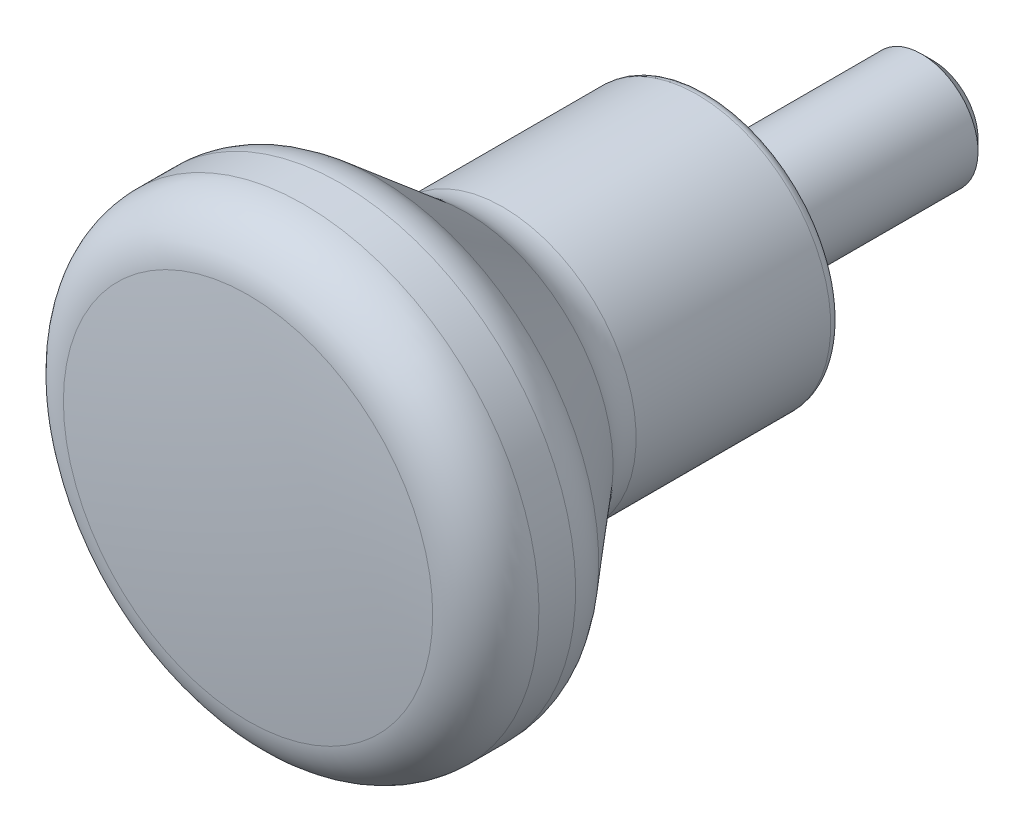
ISO-10303-21;
HEADER;
FILE_DESCRIPTION(('STEP AP214'),'2;1');
FILE_NAME('part.step','',(''),(''),'','','');
FILE_SCHEMA(('AUTOMOTIVE_DESIGN { 1 0 10303 214 1 1 1 1 }'));
ENDSEC;
DATA;
#1=APPLICATION_CONTEXT('core data for automotive mechanical design processes');
#2=APPLICATION_PROTOCOL_DEFINITION('international standard','automotive_design',2000,#1);
#3=PRODUCT_CONTEXT('',#1,'mechanical');
#4=PRODUCT('Part','Part','',(#3));
#5=PRODUCT_RELATED_PRODUCT_CATEGORY('part','',(#4));
#6=PRODUCT_DEFINITION_FORMATION('','',#4);
#7=PRODUCT_DEFINITION_CONTEXT('part definition',#1,'design');
#8=PRODUCT_DEFINITION('design','',#6,#7);
#9=PRODUCT_DEFINITION_SHAPE('','',#8);
#10=(LENGTH_UNIT() NAMED_UNIT(*) SI_UNIT(.MILLI.,.METRE.));
#11=(NAMED_UNIT(*) PLANE_ANGLE_UNIT() SI_UNIT($,.RADIAN.));
#12=(NAMED_UNIT(*) SI_UNIT($,.STERADIAN.) SOLID_ANGLE_UNIT());
#13=UNCERTAINTY_MEASURE_WITH_UNIT(LENGTH_MEASURE(1.E-05),#10,'distance_accuracy_value','');
#14=(GEOMETRIC_REPRESENTATION_CONTEXT(3) GLOBAL_UNCERTAINTY_ASSIGNED_CONTEXT((#13)) GLOBAL_UNIT_ASSIGNED_CONTEXT((#10,
#11,#12)) REPRESENTATION_CONTEXT('',''));
#15=CARTESIAN_POINT('',(0.,0.,0.));
#16=DIRECTION('',(0.,0.,1.));
#17=DIRECTION('',(1.,0.,0.));
#18=AXIS2_PLACEMENT_3D('',#15,#16,#17);
#19=CARTESIAN_POINT('',(0.,0.,-64.9999999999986));
#20=DIRECTION('',(0.,0.,-1.));
#21=DIRECTION('',(1.,0.,0.));
#22=AXIS2_PLACEMENT_3D('',#19,#20,#21);
#23=SPHERICAL_SURFACE('',#22,89.9999999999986);
#24=CARTESIAN_POINT('',(0.,0.,24.461827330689));
#25=DIRECTION('',(0.,0.,-1.));
#26=DIRECTION('',(0.,1.,0.));
#27=AXIS2_PLACEMENT_3D('',#24,#25,#26);
#28=CIRCLE('',#27,9.82758620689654);
#29=CARTESIAN_POINT('',(0.,9.82758620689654,24.461827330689));
#30=VERTEX_POINT('',#29);
#31=EDGE_CURVE('E18',#30,#30,#28,.T.);
#32=ORIENTED_EDGE('',*,*,#31,.F.);
#33=EDGE_LOOP('',(#32));
#34=FACE_BOUND('',#33,.T.);
#35=ADVANCED_FACE('F12',(#34),#23,.T.);
#36=CARTESIAN_POINT('',(0.,0.,21.479766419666));
#37=DIRECTION('',(0.,0.,-1.));
#38=DIRECTION('',(0.,1.,0.));
#39=AXIS2_PLACEMENT_3D('',#36,#37,#38);
#40=TOROIDAL_SURFACE('',#39,9.5,3.);
#41=ORIENTED_EDGE('',*,*,#31,.T.);
#42=EDGE_LOOP('',(#41));
#43=FACE_BOUND('',#42,.T.);
#44=CARTESIAN_POINT('',(0.,0.,21.479766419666));
#45=DIRECTION('',(0.,0.,-1.));
#46=DIRECTION('',(0.,1.,0.));
#47=AXIS2_PLACEMENT_3D('',#44,#45,#46);
#48=CIRCLE('',#47,12.5);
#49=CARTESIAN_POINT('',(0.,12.5,21.479766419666));
#50=VERTEX_POINT('',#49);
#51=EDGE_CURVE('E22',#50,#50,#48,.T.);
#52=ORIENTED_EDGE('',*,*,#51,.F.);
#53=EDGE_LOOP('',(#52));
#54=FACE_BOUND('',#53,.T.);
#55=ADVANCED_FACE('F69',(#43,#54),#40,.T.);
#56=CARTESIAN_POINT('',(0.,0.,0.));
#57=DIRECTION('',(0.,0.,-1.));
#58=DIRECTION('',(0.,1.,0.));
#59=AXIS2_PLACEMENT_3D('',#56,#57,#58);
#60=CYLINDRICAL_SURFACE('',#59,12.5);
#61=CARTESIAN_POINT('',(0.,0.,19.5273801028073));
#62=DIRECTION('',(0.,0.,-1.));
#63=DIRECTION('',(0.,1.,0.));
#64=AXIS2_PLACEMENT_3D('',#61,#62,#63);
#65=CIRCLE('',#64,12.5);
#66=CARTESIAN_POINT('',(0.,12.5,19.5273801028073));
#67=VERTEX_POINT('',#66);
#68=EDGE_CURVE('E26',#67,#67,#65,.T.);
#69=ORIENTED_EDGE('',*,*,#68,.F.);
#70=EDGE_LOOP('',(#69));
#71=FACE_BOUND('',#70,.T.);
#72=ORIENTED_EDGE('',*,*,#51,.T.);
#73=EDGE_LOOP('',(#72));
#74=FACE_BOUND('',#73,.T.);
#75=ADVANCED_FACE('F74',(#71,#74),#60,.T.);
#76=CARTESIAN_POINT('',(0.,0.,19.5273801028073));
#77=DIRECTION('',(0.,0.,-1.));
#78=DIRECTION('',(0.,1.,0.));
#79=AXIS2_PLACEMENT_3D('',#76,#77,#78);
#80=TOROIDAL_SURFACE('',#79,9.5,3.);
#81=ORIENTED_EDGE('',*,*,#68,.T.);
#82=EDGE_LOOP('',(#81));
#83=FACE_BOUND('',#82,.T.);
#84=CARTESIAN_POINT('',(0.,0.,17.5990172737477));
#85=DIRECTION('',(0.,0.,-1.));
#86=DIRECTION('',(0.,1.,0.));
#87=AXIS2_PLACEMENT_3D('',#84,#85,#86);
#88=CIRCLE('',#87,11.7981333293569);
#89=CARTESIAN_POINT('',(0.,11.7981333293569,17.5990172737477));
#90=VERTEX_POINT('',#89);
#91=EDGE_CURVE('E31',#90,#90,#88,.T.);
#92=ORIENTED_EDGE('',*,*,#91,.F.);
#93=EDGE_LOOP('',(#92));
#94=FACE_BOUND('',#93,.T.);
#95=ADVANCED_FACE('F78',(#83,#94),#80,.T.);
#96=CARTESIAN_POINT('',(0.,0.,17.5990172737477));
#97=DIRECTION('',(0.,0.,1.));
#98=DIRECTION('',(0.,-1.,0.));
#99=AXIS2_PLACEMENT_3D('',#96,#97,#98);
#100=CONICAL_SURFACE('',#99,11.7981333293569,0.698131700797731);
#101=CARTESIAN_POINT('',(0.,0.,12.836452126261));
#102=DIRECTION('',(0.,0.,-1.));
#103=DIRECTION('',(0.,1.,0.));
#104=AXIS2_PLACEMENT_3D('',#101,#102,#103);
#105=CIRCLE('',#104,7.80186667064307);
#106=CARTESIAN_POINT('',(0.,7.80186667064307,12.836452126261));
#107=VERTEX_POINT('',#106);
#108=EDGE_CURVE('E34',#107,#107,#105,.T.);
#109=ORIENTED_EDGE('',*,*,#108,.F.);
#110=EDGE_LOOP('',(#109));
#111=FACE_BOUND('',#110,.T.);
#112=ORIENTED_EDGE('',*,*,#91,.T.);
#113=EDGE_LOOP('',(#112));
#114=FACE_BOUND('',#113,.T.);
#115=ADVANCED_FACE('F85',(#111,#114),#100,.T.);
#116=CARTESIAN_POINT('',(0.,0.,10.9080892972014));
#117=DIRECTION('',(0.,0.,-1.));
#118=DIRECTION('',(0.,1.,0.));
#119=AXIS2_PLACEMENT_3D('',#116,#117,#118);
#120=TOROIDAL_SURFACE('',#119,10.1,3.);
#121=CARTESIAN_POINT('',(0.,0.,10.9080892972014));
#122=DIRECTION('',(0.,0.,-1.));
#123=DIRECTION('',(0.,1.,0.));
#124=AXIS2_PLACEMENT_3D('',#121,#122,#123);
#125=CIRCLE('',#124,7.1);
#126=CARTESIAN_POINT('',(0.,7.1,10.9080892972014));
#127=VERTEX_POINT('',#126);
#128=EDGE_CURVE('E37',#127,#127,#125,.T.);
#129=ORIENTED_EDGE('',*,*,#128,.F.);
#130=EDGE_LOOP('',(#129));
#131=FACE_BOUND('',#130,.T.);
#132=ORIENTED_EDGE('',*,*,#108,.T.);
#133=EDGE_LOOP('',(#132));
#134=FACE_BOUND('',#133,.T.);
#135=ADVANCED_FACE('F89',(#131,#134),#120,.F.);
#136=CARTESIAN_POINT('',(0.,0.,0.));
#137=DIRECTION('',(0.,0.,-1.));
#138=DIRECTION('',(0.,1.,0.));
#139=AXIS2_PLACEMENT_3D('',#136,#137,#138);
#140=CYLINDRICAL_SURFACE('',#139,7.1);
#141=CARTESIAN_POINT('',(0.,0.,0.55));
#142=DIRECTION('',(0.,0.,-1.));
#143=DIRECTION('',(0.,1.,0.));
#144=AXIS2_PLACEMENT_3D('',#141,#142,#143);
#145=CIRCLE('',#144,7.1);
#146=CARTESIAN_POINT('',(0.,7.1,0.55));
#147=VERTEX_POINT('',#146);
#148=EDGE_CURVE('E40',#147,#147,#145,.T.);
#149=ORIENTED_EDGE('',*,*,#148,.F.);
#150=EDGE_LOOP('',(#149));
#151=FACE_BOUND('',#150,.T.);
#152=ORIENTED_EDGE('',*,*,#128,.T.);
#153=EDGE_LOOP('',(#152));
#154=FACE_BOUND('',#153,.T.);
#155=ADVANCED_FACE('F93',(#151,#154),#140,.T.);
#156=CARTESIAN_POINT('',(0.,0.,0.55));
#157=DIRECTION('',(0.,0.,-1.));
#158=DIRECTION('',(0.,1.,0.));
#159=AXIS2_PLACEMENT_3D('',#156,#157,#158);
#160=TOROIDAL_SURFACE('',#159,6.55,0.55);
#161=ORIENTED_EDGE('',*,*,#148,.T.);
#162=EDGE_LOOP('',(#161));
#163=FACE_BOUND('',#162,.T.);
#164=CARTESIAN_POINT('',(0.,0.,0.));
#165=DIRECTION('',(0.,0.,-1.));
#166=DIRECTION('',(0.,1.,0.));
#167=AXIS2_PLACEMENT_3D('',#164,#165,#166);
#168=CIRCLE('',#167,6.55);
#169=CARTESIAN_POINT('',(0.,6.55,0.));
#170=VERTEX_POINT('',#169);
#171=EDGE_CURVE('E43',#170,#170,#168,.T.);
#172=ORIENTED_EDGE('',*,*,#171,.F.);
#173=EDGE_LOOP('',(#172));
#174=FACE_BOUND('',#173,.T.);
#175=ADVANCED_FACE('F97',(#163,#174),#160,.T.);
#176=CARTESIAN_POINT('',(6.55,0.,0.));
#177=DIRECTION('',(0.,0.,1.));
#178=DIRECTION('',(0.,-1.,0.));
#179=AXIS2_PLACEMENT_3D('',#176,#177,#178);
#180=PLANE('',#179);
#181=CARTESIAN_POINT('',(0.,0.,0.));
#182=DIRECTION('',(0.,0.,1.));
#183=DIRECTION('',(0.,-1.,0.));
#184=AXIS2_PLACEMENT_3D('',#181,#182,#183);
#185=CIRCLE('',#184,3.);
#186=CARTESIAN_POINT('',(0.,-3.,0.));
#187=VERTEX_POINT('',#186);
#188=EDGE_CURVE('E8',#187,#187,#185,.F.);
#189=ORIENTED_EDGE('',*,*,#188,.F.);
#190=EDGE_LOOP('',(#189));
#191=FACE_BOUND('',#190,.T.);
#192=ORIENTED_EDGE('',*,*,#171,.T.);
#193=EDGE_LOOP('',(#192));
#194=FACE_BOUND('',#193,.T.);
#195=ADVANCED_FACE('F100',(#191,#194),#180,.F.);
#196=CARTESIAN_POINT('',(2.3865,0.,-12.));
#197=DIRECTION('',(0.,0.,1.));
#198=DIRECTION('',(0.,-1.,0.));
#199=AXIS2_PLACEMENT_3D('',#196,#197,#198);
#200=PLANE('',#199);
#201=CARTESIAN_POINT('',(0.,0.,-12.));
#202=DIRECTION('',(0.,0.,-1.));
#203=DIRECTION('',(0.,1.,0.));
#204=AXIS2_PLACEMENT_3D('',#201,#202,#203);
#205=CIRCLE('',#204,2.3865);
#206=CARTESIAN_POINT('',(0.,2.3865,-12.));
#207=VERTEX_POINT('',#206);
#208=EDGE_CURVE('E49',#207,#207,#205,.T.);
#209=ORIENTED_EDGE('',*,*,#208,.T.);
#210=EDGE_LOOP('',(#209));
#211=FACE_BOUND('',#210,.T.);
#212=ADVANCED_FACE('F53',(#211),#200,.F.);
#213=CARTESIAN_POINT('',(0.,0.,-11.3865));
#214=DIRECTION('',(0.,0.,1.));
#215=DIRECTION('',(0.,-1.,0.));
#216=AXIS2_PLACEMENT_3D('',#213,#214,#215);
#217=CONICAL_SURFACE('',#216,3.,0.785398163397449);
#218=ORIENTED_EDGE('',*,*,#208,.F.);
#219=EDGE_LOOP('',(#218));
#220=FACE_BOUND('',#219,.T.);
#221=CARTESIAN_POINT('',(0.,0.,-11.3865));
#222=DIRECTION('',(0.,0.,-1.));
#223=DIRECTION('',(0.,1.,0.));
#224=AXIS2_PLACEMENT_3D('',#221,#222,#223);
#225=CIRCLE('',#224,3.);
#226=CARTESIAN_POINT('',(0.,3.,-11.3865));
#227=VERTEX_POINT('',#226);
#228=EDGE_CURVE('E46',#227,#227,#225,.T.);
#229=ORIENTED_EDGE('',*,*,#228,.T.);
#230=EDGE_LOOP('',(#229));
#231=FACE_BOUND('',#230,.T.);
#232=ADVANCED_FACE('F55',(#220,#231),#217,.T.);
#233=CARTESIAN_POINT('',(0.,0.,-12.));
#234=DIRECTION('',(0.,0.,-1.));
#235=DIRECTION('',(0.,1.,0.));
#236=AXIS2_PLACEMENT_3D('',#233,#234,#235);
#237=CYLINDRICAL_SURFACE('',#236,3.);
#238=ORIENTED_EDGE('',*,*,#228,.F.);
#239=EDGE_LOOP('',(#238));
#240=FACE_BOUND('',#239,.T.);
#241=ORIENTED_EDGE('',*,*,#188,.T.);
#242=EDGE_LOOP('',(#241));
#243=FACE_BOUND('',#242,.T.);
#244=ADVANCED_FACE('F58',(#240,#243),#237,.T.);
#245=CLOSED_SHELL('',(#35,#55,#75,#95,#115,#135,#155,#175,#195,#212,#232,#244));
#246=MANIFOLD_SOLID_BREP('B1',#245);
#247=ADVANCED_BREP_SHAPE_REPRESENTATION('',(#18,#246),#14);
#248=SHAPE_DEFINITION_REPRESENTATION(#9,#247);
ENDSEC;
END-ISO-10303-21;
